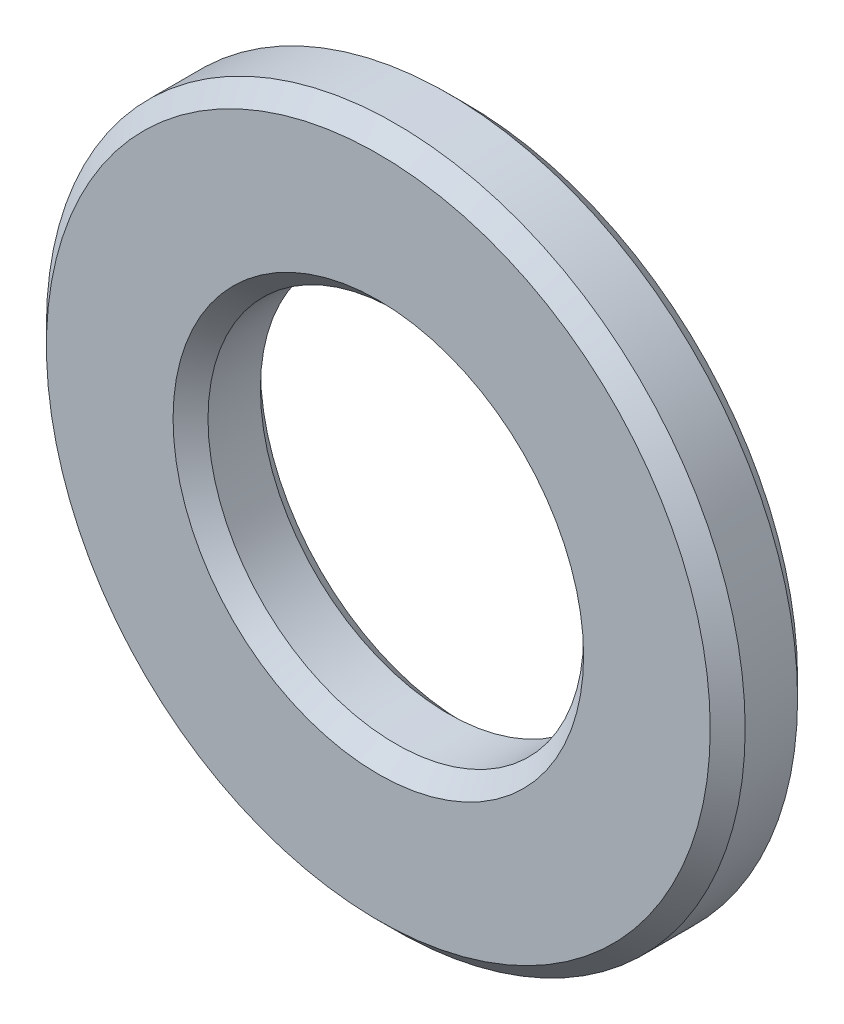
from build123d import *

# Parameters (mm, degrees)
SKETCH1_R           = 4
SKETCH1_R_2         = 2.15
BOSS_EXTRUDE2_DEPTH = 0.5
CHAMFER3_SIZE       = 0.2


with BuildPart() as part:
    # Sketch1 → Boss-Extrude2 (new, symmetric)
    with BuildSketch(Plane.XY):
        Circle(SKETCH1_R)
        Circle(SKETCH1_R_2, mode=Mode.SUBTRACT)
    extrude(amount=BOSS_EXTRUDE2_DEPTH, both=True)

    # Chamfer3
    chamfer3_edges = [part.edges().sort_by_distance(p)[0] for p in [
        (-4, 0, -0.5),
        (-4, 0, 0.5),
        (-2.15, 0, -0.5),
        (-2.15, 0, 0.5),
    ]]
    chamfer(chamfer3_edges, length=CHAMFER3_SIZE)


solid = part.part
